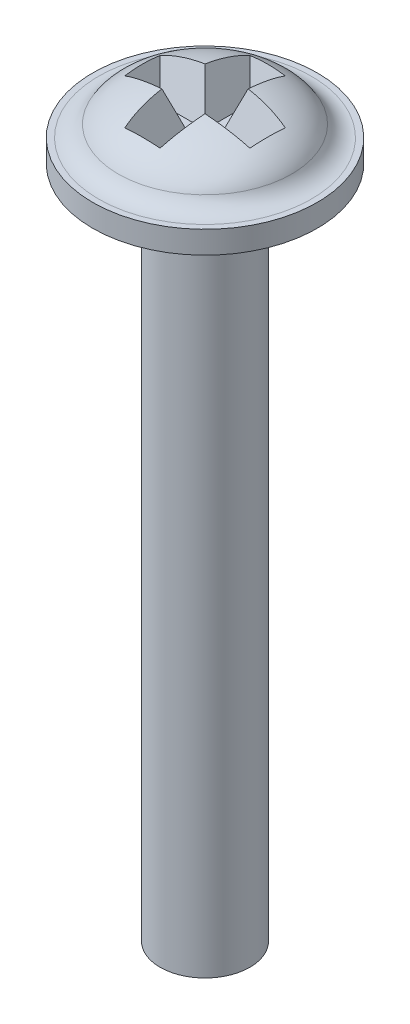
from build123d import *

# Parameters (mm, degrees)
SKETCH1_R           = 2.5
BOSS_EXTRUDE1_DEPTH = 0.5
FILLET1_R           = 0.5
CUT_EXTRUDE1_DEPTH  = 1
CUT_EXTRUDE1_DRAFT  = -19
SKETCH5_R           = 1
BOSS_EXTRUDE2_DEPTH = 15


with BuildPart() as part:
    # Sketch1 → Boss-Extrude1 (new body)
    with BuildSketch(Plane(origin=(0, 0, 0), x_dir=(1, 0, 0), z_dir=(0, 1, 0))):
        with Locations(Location((0, 0, 0), (0, 0, 270))):
            Circle(SKETCH1_R)
    extrude(amount=BOSS_EXTRUDE1_DEPTH)

    # Sketch2 → Revolve1 (revolve)
    with BuildSketch(Plane(origin=(0, 0, 0), x_dir=(0, 0, -1), z_dir=(1, 0, 0))):
        with BuildLine():
            Line((0, 1.5), (0, 0.5))
            Line((0, 0.5), (-2, 0.5))
            add(Edge.make_bspline(
                [(0, 1.5), (-2, 1.5), (-2, 0.5)],
                knots=[4.71238898, 4.71238898, 4.71238898, 6.283185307, 6.283185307, 6.283185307], degree=2, weights=[1, 0.707106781, 1]))
        make_face()
    revolve(axis=Axis((0, 1.5, 0), (0, -1, 0)))

    # Fillet1
    fillet1_edges = [part.edges().sort_by_distance(p)[0] for p in [
        (0, 0.5, -2),
    ]]
    fillet(fillet1_edges, radius=FILLET1_R)


with BuildPart() as cut_extrude1_tool:
    # Sketch3 → Cut-Extrude1 (with draft: the straight prism first)
    with BuildSketch(Plane(origin=(0, 1.5, 0), x_dir=(1, 0, 0), z_dir=(0, 1, 0))):
        Polygon((0.5, 1.5), (-0.5, 1.5), (-0.5, 0.5), (-1.5, 0.5), (-1.5, -0.5), (-0.5, -0.5), (-0.5, -1.5), (0.5, -1.5), (0.5, -0.5), (1.5, -0.5), (1.5, 0.5), (0.5, 0.5), align=None)
    extrude(amount=-CUT_EXTRUDE1_DEPTH)
    # Cut-Extrude1: the draft: its side faces are tilted about the plane it starts from
    cut_extrude1_sides = [cut_extrude1_tool.faces().sort_by_distance(p)[0] for p in [
        (0, 1, -1.5),
        (-0.5, 1, -1),
        (-1, 1, -0.5),
        (-1.5, 1, 0),
        (-1, 1, 0.5),
        (-0.5, 1, 1),
        (0, 1, 1.5),
        (0.5, 1, 1),
        (1, 1, 0.5),
        (1.5, 1, 0),
        (1, 1, -0.5),
        (0.5, 1, -1),
    ]]
    draft(cut_extrude1_sides, Plane(origin=(0, 1.5, 0), x_dir=(1, 0, 0), z_dir=(0, 1, 0)), CUT_EXTRUDE1_DRAFT)


with BuildPart() as part_1:
    add(part.part)

    # Cut-Extrude1: cut by cut_extrude1_tool
    add(cut_extrude1_tool.part, mode=Mode.SUBTRACT)

    # Sketch5 → Boss-Extrude2 (add)
    with BuildSketch(Plane.XZ):
        with Locations(Location((0, 0, 0), (0, 0, 90))):
            Circle(SKETCH5_R)
    extrude(amount=BOSS_EXTRUDE2_DEPTH)


solid = part_1.part
